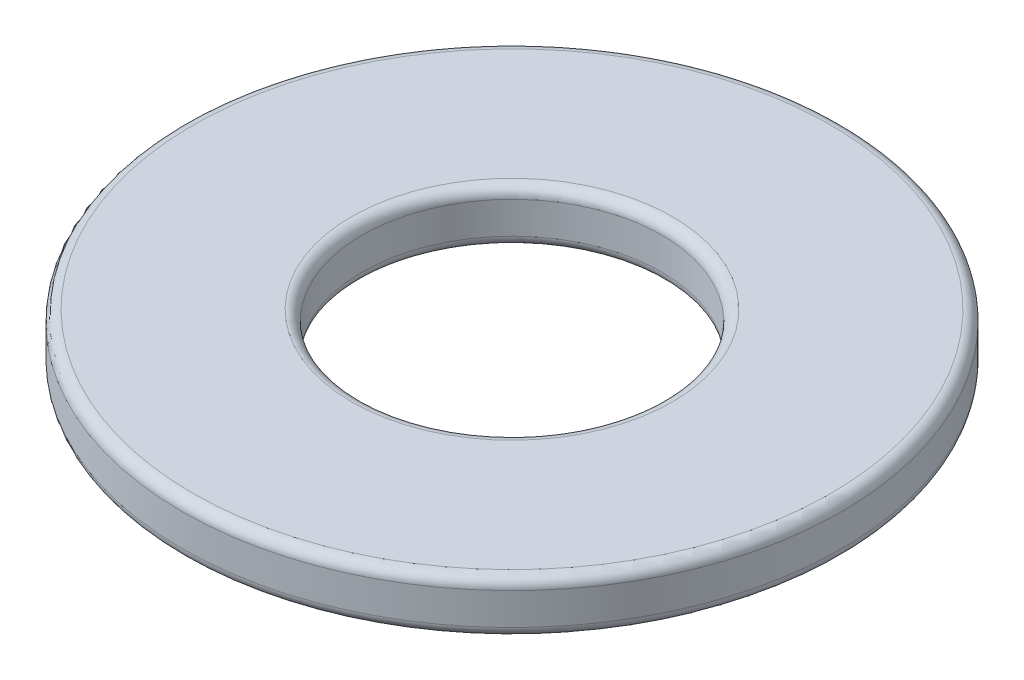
ISO-10303-21;
HEADER;
FILE_DESCRIPTION(('STEP AP214'),'2;1');
FILE_NAME('part.step','',(''),(''),'','','');
FILE_SCHEMA(('AUTOMOTIVE_DESIGN { 1 0 10303 214 1 1 1 1 }'));
ENDSEC;
DATA;
#1=APPLICATION_CONTEXT('core data for automotive mechanical design processes');
#2=APPLICATION_PROTOCOL_DEFINITION('international standard','automotive_design',2000,#1);
#3=PRODUCT_CONTEXT('',#1,'mechanical');
#4=PRODUCT('Part','Part','',(#3));
#5=PRODUCT_RELATED_PRODUCT_CATEGORY('part','',(#4));
#6=PRODUCT_DEFINITION_FORMATION('','',#4);
#7=PRODUCT_DEFINITION_CONTEXT('part definition',#1,'design');
#8=PRODUCT_DEFINITION('design','',#6,#7);
#9=PRODUCT_DEFINITION_SHAPE('','',#8);
#10=(LENGTH_UNIT() NAMED_UNIT(*) SI_UNIT(.MILLI.,.METRE.));
#11=(NAMED_UNIT(*) PLANE_ANGLE_UNIT() SI_UNIT($,.RADIAN.));
#12=(NAMED_UNIT(*) SI_UNIT($,.STERADIAN.) SOLID_ANGLE_UNIT());
#13=UNCERTAINTY_MEASURE_WITH_UNIT(LENGTH_MEASURE(1.E-05),#10,'distance_accuracy_value','');
#14=(GEOMETRIC_REPRESENTATION_CONTEXT(3) GLOBAL_UNCERTAINTY_ASSIGNED_CONTEXT((#13)) GLOBAL_UNIT_ASSIGNED_CONTEXT((#10,
#11,#12)) REPRESENTATION_CONTEXT('',''));
#15=CARTESIAN_POINT('',(0.,0.,0.));
#16=DIRECTION('',(0.,0.,1.));
#17=DIRECTION('',(1.,0.,0.));
#18=AXIS2_PLACEMENT_3D('',#15,#16,#17);
#19=CARTESIAN_POINT('',(0.,1.016,0.));
#20=DIRECTION('',(0.,1.,0.));
#21=DIRECTION('',(0.,0.,1.));
#22=AXIS2_PLACEMENT_3D('',#19,#20,#21);
#23=PLANE('',#22);
#24=CARTESIAN_POINT('',(0.,1.016,0.));
#25=DIRECTION('',(0.,1.,0.));
#26=DIRECTION('',(0.,0.,1.));
#27=AXIS2_PLACEMENT_3D('',#24,#25,#26);
#28=CIRCLE('',#27,3.0607);
#29=CARTESIAN_POINT('',(0.,1.016,3.0607));
#30=VERTEX_POINT('',#29);
#31=EDGE_CURVE('E50',#30,#30,#28,.F.);
#32=ORIENTED_EDGE('',*,*,#31,.T.);
#33=EDGE_LOOP('',(#32));
#34=FACE_BOUND('',#33,.T.);
#35=CARTESIAN_POINT('',(0.,1.016,0.));
#36=DIRECTION('',(0.,1.,0.));
#37=DIRECTION('',(0.,0.,1.));
#38=AXIS2_PLACEMENT_3D('',#35,#36,#37);
#39=CIRCLE('',#38,6.0833);
#40=CARTESIAN_POINT('',(0.,1.016,6.0833));
#41=VERTEX_POINT('',#40);
#42=EDGE_CURVE('E53',#41,#41,#39,.T.);
#43=ORIENTED_EDGE('',*,*,#42,.T.);
#44=EDGE_LOOP('',(#43));
#45=FACE_BOUND('',#44,.T.);
#46=ADVANCED_FACE('F30',(#34,#45),#23,.T.);
#47=CARTESIAN_POINT('',(0.,0.,0.));
#48=DIRECTION('',(0.,1.,0.));
#49=DIRECTION('',(0.,0.,1.));
#50=AXIS2_PLACEMENT_3D('',#47,#48,#49);
#51=PLANE('',#50);
#52=CARTESIAN_POINT('',(0.,0.,0.));
#53=DIRECTION('',(0.,1.,0.));
#54=DIRECTION('',(0.,0.,1.));
#55=AXIS2_PLACEMENT_3D('',#52,#53,#54);
#56=CIRCLE('',#55,3.0607);
#57=CARTESIAN_POINT('',(0.,0.,3.0607));
#58=VERTEX_POINT('',#57);
#59=EDGE_CURVE('E10',#58,#58,#56,.T.);
#60=ORIENTED_EDGE('',*,*,#59,.T.);
#61=EDGE_LOOP('',(#60));
#62=FACE_BOUND('',#61,.T.);
#63=CARTESIAN_POINT('',(0.,0.,0.));
#64=DIRECTION('',(0.,1.,0.));
#65=DIRECTION('',(0.,0.,1.));
#66=AXIS2_PLACEMENT_3D('',#63,#64,#65);
#67=CIRCLE('',#66,6.0833);
#68=CARTESIAN_POINT('',(0.,0.,6.0833));
#69=VERTEX_POINT('',#68);
#70=EDGE_CURVE('E37',#69,#69,#67,.F.);
#71=ORIENTED_EDGE('',*,*,#70,.T.);
#72=EDGE_LOOP('',(#71));
#73=FACE_BOUND('',#72,.T.);
#74=ADVANCED_FACE('F81',(#62,#73),#51,.F.);
#75=CARTESIAN_POINT('',(0.,1.016,0.));
#76=DIRECTION('',(0.,-1.,0.));
#77=DIRECTION('',(0.,0.,-1.));
#78=AXIS2_PLACEMENT_3D('',#75,#76,#77);
#79=CYLINDRICAL_SURFACE('',#78,6.2865);
#80=CARTESIAN_POINT('',(0.,0.8128,0.));
#81=DIRECTION('',(0.,1.,0.));
#82=DIRECTION('',(0.,0.,1.));
#83=AXIS2_PLACEMENT_3D('',#80,#81,#82);
#84=CIRCLE('',#83,6.2865);
#85=CARTESIAN_POINT('',(0.,0.8128,6.2865));
#86=VERTEX_POINT('',#85);
#87=EDGE_CURVE('E41',#86,#86,#84,.F.);
#88=ORIENTED_EDGE('',*,*,#87,.T.);
#89=EDGE_LOOP('',(#88));
#90=FACE_BOUND('',#89,.T.);
#91=CARTESIAN_POINT('',(0.,0.2032,0.));
#92=DIRECTION('',(0.,1.,0.));
#93=DIRECTION('',(0.,0.,1.));
#94=AXIS2_PLACEMENT_3D('',#91,#92,#93);
#95=CIRCLE('',#94,6.2865);
#96=CARTESIAN_POINT('',(0.,0.2032,6.2865));
#97=VERTEX_POINT('',#96);
#98=EDGE_CURVE('E45',#97,#97,#95,.T.);
#99=ORIENTED_EDGE('',*,*,#98,.T.);
#100=EDGE_LOOP('',(#99));
#101=FACE_BOUND('',#100,.T.);
#102=ADVANCED_FACE('F32',(#90,#101),#79,.T.);
#103=CARTESIAN_POINT('',(0.,1.016,0.));
#104=DIRECTION('',(0.,-1.,0.));
#105=DIRECTION('',(0.,0.,-1.));
#106=AXIS2_PLACEMENT_3D('',#103,#104,#105);
#107=CYLINDRICAL_SURFACE('',#106,2.8575);
#108=CARTESIAN_POINT('',(0.,0.8128,0.));
#109=DIRECTION('',(0.,1.,0.));
#110=DIRECTION('',(0.,0.,1.));
#111=AXIS2_PLACEMENT_3D('',#108,#109,#110);
#112=CIRCLE('',#111,2.8575);
#113=CARTESIAN_POINT('',(0.,0.8128,2.8575));
#114=VERTEX_POINT('',#113);
#115=EDGE_CURVE('E56',#114,#114,#112,.T.);
#116=ORIENTED_EDGE('',*,*,#115,.T.);
#117=EDGE_LOOP('',(#116));
#118=FACE_BOUND('',#117,.T.);
#119=CARTESIAN_POINT('',(0.,0.2032,0.));
#120=DIRECTION('',(0.,1.,0.));
#121=DIRECTION('',(0.,0.,1.));
#122=AXIS2_PLACEMENT_3D('',#119,#120,#121);
#123=CIRCLE('',#122,2.8575);
#124=CARTESIAN_POINT('',(0.,0.2032,2.8575));
#125=VERTEX_POINT('',#124);
#126=EDGE_CURVE('E59',#125,#125,#123,.F.);
#127=ORIENTED_EDGE('',*,*,#126,.T.);
#128=EDGE_LOOP('',(#127));
#129=FACE_BOUND('',#128,.T.);
#130=ADVANCED_FACE('F63',(#118,#129),#107,.F.);
#131=CARTESIAN_POINT('',(0.,0.8128,0.));
#132=DIRECTION('',(0.,1.,0.));
#133=DIRECTION('',(0.,0.,1.));
#134=AXIS2_PLACEMENT_3D('',#131,#132,#133);
#135=TOROIDAL_SURFACE('',#134,3.0607,0.2032);
#136=ORIENTED_EDGE('',*,*,#31,.F.);
#137=EDGE_LOOP('',(#136));
#138=FACE_BOUND('',#137,.T.);
#139=ORIENTED_EDGE('',*,*,#115,.F.);
#140=EDGE_LOOP('',(#139));
#141=FACE_BOUND('',#140,.T.);
#142=ADVANCED_FACE('F77',(#138,#141),#135,.T.);
#143=CARTESIAN_POINT('',(0.,0.8128,0.));
#144=DIRECTION('',(0.,1.,0.));
#145=DIRECTION('',(0.,0.,1.));
#146=AXIS2_PLACEMENT_3D('',#143,#144,#145);
#147=TOROIDAL_SURFACE('',#146,6.0833,0.2032);
#148=ORIENTED_EDGE('',*,*,#87,.F.);
#149=EDGE_LOOP('',(#148));
#150=FACE_BOUND('',#149,.T.);
#151=ORIENTED_EDGE('',*,*,#42,.F.);
#152=EDGE_LOOP('',(#151));
#153=FACE_BOUND('',#152,.T.);
#154=ADVANCED_FACE('F69',(#150,#153),#147,.T.);
#155=CARTESIAN_POINT('',(0.,0.2032,0.));
#156=DIRECTION('',(0.,1.,0.));
#157=DIRECTION('',(0.,0.,1.));
#158=AXIS2_PLACEMENT_3D('',#155,#156,#157);
#159=TOROIDAL_SURFACE('',#158,3.0607,0.2032);
#160=ORIENTED_EDGE('',*,*,#126,.F.);
#161=EDGE_LOOP('',(#160));
#162=FACE_BOUND('',#161,.T.);
#163=ORIENTED_EDGE('',*,*,#59,.F.);
#164=EDGE_LOOP('',(#163));
#165=FACE_BOUND('',#164,.T.);
#166=ADVANCED_FACE('F65',(#162,#165),#159,.T.);
#167=CARTESIAN_POINT('',(0.,0.2032,0.));
#168=DIRECTION('',(0.,1.,0.));
#169=DIRECTION('',(0.,0.,1.));
#170=AXIS2_PLACEMENT_3D('',#167,#168,#169);
#171=TOROIDAL_SURFACE('',#170,6.0833,0.2032);
#172=ORIENTED_EDGE('',*,*,#70,.F.);
#173=EDGE_LOOP('',(#172));
#174=FACE_BOUND('',#173,.T.);
#175=ORIENTED_EDGE('',*,*,#98,.F.);
#176=EDGE_LOOP('',(#175));
#177=FACE_BOUND('',#176,.T.);
#178=ADVANCED_FACE('F68',(#174,#177),#171,.T.);
#179=CLOSED_SHELL('',(#46,#74,#102,#130,#142,#154,#166,#178));
#180=MANIFOLD_SOLID_BREP('B2',#179);
#181=ADVANCED_BREP_SHAPE_REPRESENTATION('',(#18,#180),#14);
#182=SHAPE_DEFINITION_REPRESENTATION(#9,#181);
ENDSEC;
END-ISO-10303-21;
